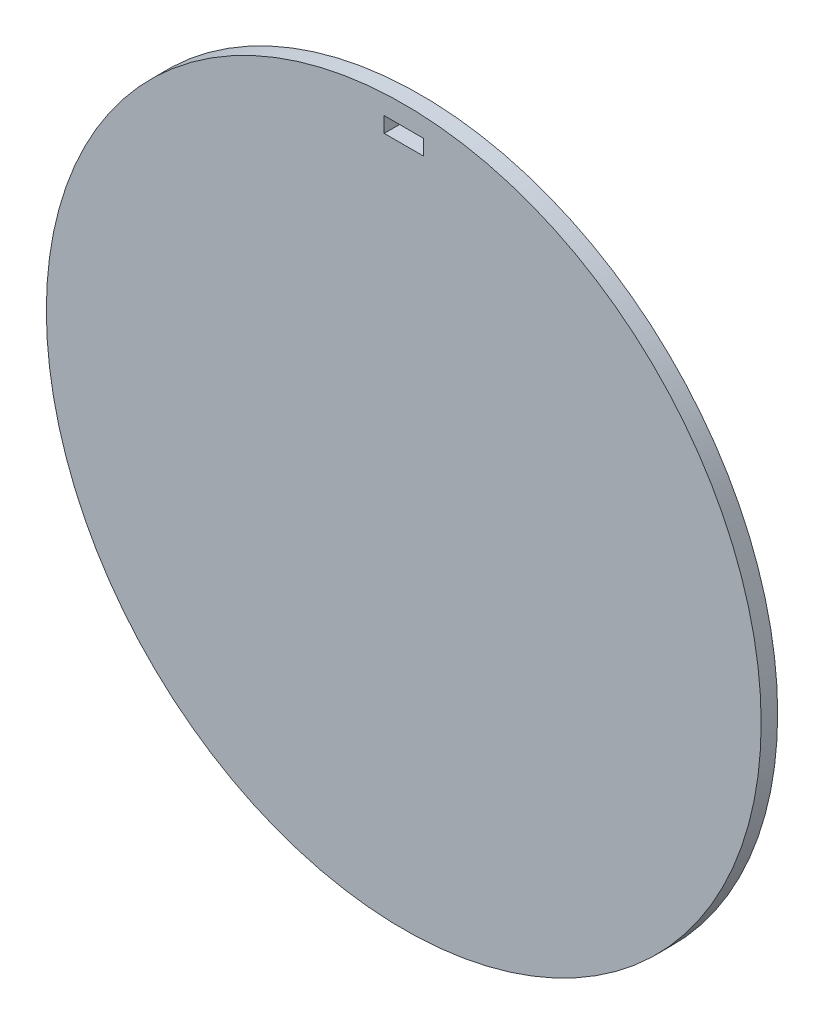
from build123d import *

# Parameters (mm, degrees)
SKETCH1_R           = 65
SKETCH1_W           = 7.108
SKETCH1_H           = 2.8
BOSS_EXTRUDE1_DEPTH = 3


with BuildPart() as part:
    # Sketch1 → Boss-Extrude1 (new body)
    with BuildSketch(Plane.XY):
        Circle(SKETCH1_R)
        with Locations((0, 60)):
            Rectangle(SKETCH1_W, SKETCH1_H, mode=Mode.SUBTRACT)
    extrude(amount=BOSS_EXTRUDE1_DEPTH)


solid = part.part
